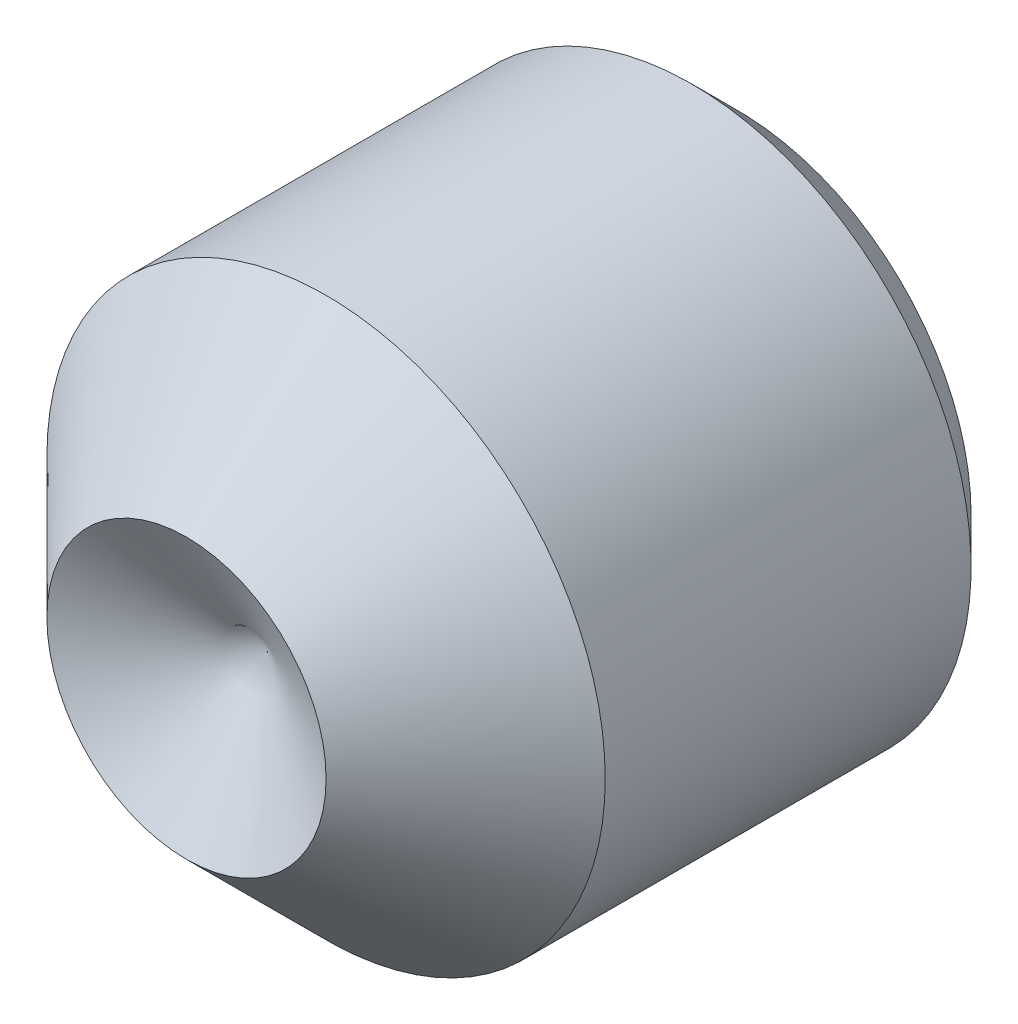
ISO-10303-21;
HEADER;
FILE_DESCRIPTION(('STEP AP214'),'2;1');
FILE_NAME('part.step','',(''),(''),'','','');
FILE_SCHEMA(('AUTOMOTIVE_DESIGN { 1 0 10303 214 1 1 1 1 }'));
ENDSEC;
DATA;
#1=APPLICATION_CONTEXT('core data for automotive mechanical design processes');
#2=APPLICATION_PROTOCOL_DEFINITION('international standard','automotive_design',2000,#1);
#3=PRODUCT_CONTEXT('',#1,'mechanical');
#4=PRODUCT('Part','Part','',(#3));
#5=PRODUCT_RELATED_PRODUCT_CATEGORY('part','',(#4));
#6=PRODUCT_DEFINITION_FORMATION('','',#4);
#7=PRODUCT_DEFINITION_CONTEXT('part definition',#1,'design');
#8=PRODUCT_DEFINITION('design','',#6,#7);
#9=PRODUCT_DEFINITION_SHAPE('','',#8);
#10=(LENGTH_UNIT() NAMED_UNIT(*) SI_UNIT(.MILLI.,.METRE.));
#11=(NAMED_UNIT(*) PLANE_ANGLE_UNIT() SI_UNIT($,.RADIAN.));
#12=(NAMED_UNIT(*) SI_UNIT($,.STERADIAN.) SOLID_ANGLE_UNIT());
#13=UNCERTAINTY_MEASURE_WITH_UNIT(LENGTH_MEASURE(1.E-05),#10,'distance_accuracy_value','');
#14=(GEOMETRIC_REPRESENTATION_CONTEXT(3) GLOBAL_UNCERTAINTY_ASSIGNED_CONTEXT((#13)) GLOBAL_UNIT_ASSIGNED_CONTEXT((#10,
#11,#12)) REPRESENTATION_CONTEXT('',''));
#15=CARTESIAN_POINT('',(0.,0.,0.));
#16=DIRECTION('',(0.,0.,1.));
#17=DIRECTION('',(1.,0.,0.));
#18=AXIS2_PLACEMENT_3D('',#15,#16,#17);
#19=CARTESIAN_POINT('',(0.,0.,-10.585154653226));
#20=DIRECTION('',(0.,0.,-1.));
#21=DIRECTION('',(-1.,0.,0.));
#22=AXIS2_PLACEMENT_3D('',#19,#20,#21);
#23=CYLINDRICAL_SURFACE('',#22,2.413);
#24=CARTESIAN_POINT('',(0.,0.,0.393699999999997));
#25=DIRECTION('',(0.,0.,-1.));
#26=DIRECTION('',(-1.,0.,0.));
#27=AXIS2_PLACEMENT_3D('',#24,#25,#26);
#28=CIRCLE('',#27,2.413);
#29=CARTESIAN_POINT('',(-2.413,0.,0.393699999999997));
#30=VERTEX_POINT('',#29);
#31=EDGE_CURVE('E58',#30,#30,#28,.T.);
#32=ORIENTED_EDGE('',*,*,#31,.F.);
#33=EDGE_LOOP('',(#32));
#34=FACE_BOUND('',#33,.T.);
#35=CARTESIAN_POINT('',(0.,0.,3.556));
#36=DIRECTION('',(0.,0.,1.));
#37=DIRECTION('',(1.,0.,0.));
#38=AXIS2_PLACEMENT_3D('',#35,#36,#37);
#39=CIRCLE('',#38,2.413);
#40=CARTESIAN_POINT('',(2.413,0.,3.556));
#41=VERTEX_POINT('',#40);
#42=EDGE_CURVE('E188',#41,#41,#39,.T.);
#43=ORIENTED_EDGE('',*,*,#42,.F.);
#44=EDGE_LOOP('',(#43));
#45=FACE_BOUND('',#44,.T.);
#46=ADVANCED_FACE('F49',(#34,#45),#23,.T.);
#47=CARTESIAN_POINT('',(0.,0.,0.));
#48=DIRECTION('',(0.,0.,1.));
#49=DIRECTION('',(1.,0.,0.));
#50=AXIS2_PLACEMENT_3D('',#47,#48,#49);
#51=PLANE('',#50);
#52=DIRECTION('',(-0.5,-0.866025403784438,0.));
#53=VECTOR('',#52,1.);
#54=CARTESIAN_POINT('',(1.37408209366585,0.,0.));
#55=LINE('',#54,#53);
#56=CARTESIAN_POINT('',(1.37408209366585,0.,0.));
#57=VERTEX_POINT('',#56);
#58=CARTESIAN_POINT('',(0.687041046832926,-1.18999,1.45716771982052E-13));
#59=VERTEX_POINT('',#58);
#60=EDGE_CURVE('E148',#57,#59,#55,.T.);
#61=ORIENTED_EDGE('',*,*,#60,.F.);
#62=DIRECTION('',(0.5,-0.866025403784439,0.));
#63=VECTOR('',#62,1.);
#64=CARTESIAN_POINT('',(0.687041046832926,1.18999,0.));
#65=LINE('',#64,#63);
#66=CARTESIAN_POINT('',(0.687041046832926,1.18999,0.));
#67=VERTEX_POINT('',#66);
#68=EDGE_CURVE('E65',#67,#57,#65,.T.);
#69=ORIENTED_EDGE('',*,*,#68,.F.);
#70=DIRECTION('',(1.,0.,0.));
#71=VECTOR('',#70,1.);
#72=CARTESIAN_POINT('',(-0.687041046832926,1.18999,0.));
#73=LINE('',#72,#71);
#74=CARTESIAN_POINT('',(-0.687041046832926,1.18999,0.));
#75=VERTEX_POINT('',#74);
#76=EDGE_CURVE('E162',#75,#67,#73,.T.);
#77=ORIENTED_EDGE('',*,*,#76,.F.);
#78=DIRECTION('',(0.5,0.866025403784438,0.));
#79=VECTOR('',#78,1.);
#80=CARTESIAN_POINT('',(-1.37408209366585,0.,0.));
#81=LINE('',#80,#79);
#82=CARTESIAN_POINT('',(-1.37408209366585,0.,0.));
#83=VERTEX_POINT('',#82);
#84=EDGE_CURVE('E159',#83,#75,#81,.T.);
#85=ORIENTED_EDGE('',*,*,#84,.F.);
#86=DIRECTION('',(-0.499999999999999,0.866025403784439,0.));
#87=VECTOR('',#86,1.);
#88=CARTESIAN_POINT('',(-0.687041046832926,-1.18999,1.45716771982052E-13));
#89=LINE('',#88,#87);
#90=CARTESIAN_POINT('',(-0.687041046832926,-1.18999,1.45716771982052E-13));
#91=VERTEX_POINT('',#90);
#92=EDGE_CURVE('E115',#91,#83,#89,.T.);
#93=ORIENTED_EDGE('',*,*,#92,.F.);
#94=DIRECTION('',(-1.,0.,0.));
#95=VECTOR('',#94,1.);
#96=CARTESIAN_POINT('',(0.687041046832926,-1.18999,1.45716771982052E-13));
#97=LINE('',#96,#95);
#98=EDGE_CURVE('E153',#59,#91,#97,.T.);
#99=ORIENTED_EDGE('',*,*,#98,.F.);
#100=EDGE_LOOP('',(#61,#69,#77,#85,#93,#99));
#101=FACE_BOUND('',#100,.T.);
#102=CARTESIAN_POINT('',(0.,0.,0.));
#103=DIRECTION('',(0.,0.,-1.));
#104=DIRECTION('',(-1.,0.,0.));
#105=AXIS2_PLACEMENT_3D('',#102,#103,#104);
#106=CIRCLE('',#105,2.0193);
#107=CARTESIAN_POINT('',(-2.0193,0.,0.));
#108=VERTEX_POINT('',#107);
#109=EDGE_CURVE('E11',#108,#108,#106,.T.);
#110=ORIENTED_EDGE('',*,*,#109,.T.);
#111=EDGE_LOOP('',(#110));
#112=FACE_BOUND('',#111,.T.);
#113=ADVANCED_FACE('F51',(#101,#112),#51,.F.);
#114=CARTESIAN_POINT('',(0.,0.,0.393699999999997));
#115=DIRECTION('',(0.,0.,1.));
#116=DIRECTION('',(1.,0.,0.));
#117=AXIS2_PLACEMENT_3D('',#114,#115,#116);
#118=CONICAL_SURFACE('',#117,2.413,0.785398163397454);
#119=ORIENTED_EDGE('',*,*,#109,.F.);
#120=EDGE_LOOP('',(#119));
#121=FACE_BOUND('',#120,.T.);
#122=ORIENTED_EDGE('',*,*,#31,.T.);
#123=EDGE_LOOP('',(#122));
#124=FACE_BOUND('',#123,.T.);
#125=ADVANCED_FACE('F181',(#121,#124),#118,.T.);
#126=CARTESIAN_POINT('',(0.687041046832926,1.18999,2.5));
#127=DIRECTION('',(0.866025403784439,0.5,0.));
#128=DIRECTION('',(-0.5,0.866025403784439,0.));
#129=AXIS2_PLACEMENT_3D('',#126,#127,#128);
#130=PLANE('',#129);
#131=ORIENTED_EDGE('',*,*,#68,.T.);
#132=DIRECTION('',(0.,0.,-1.));
#133=VECTOR('',#132,1.);
#134=CARTESIAN_POINT('',(1.37408209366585,0.,2.5));
#135=LINE('',#134,#133);
#136=CARTESIAN_POINT('',(1.37408209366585,0.,2.5));
#137=VERTEX_POINT('',#136);
#138=EDGE_CURVE('E96',#137,#57,#135,.T.);
#139=ORIENTED_EDGE('',*,*,#138,.F.);
#140=DIRECTION('',(0.5,-0.866025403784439,0.));
#141=VECTOR('',#140,1.);
#142=CARTESIAN_POINT('',(0.687041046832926,1.18999,2.5));
#143=LINE('',#142,#141);
#144=CARTESIAN_POINT('',(0.687041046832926,1.18999,2.5));
#145=VERTEX_POINT('',#144);
#146=EDGE_CURVE('E165',#145,#137,#143,.T.);
#147=ORIENTED_EDGE('',*,*,#146,.F.);
#148=DIRECTION('',(0.,0.,-1.));
#149=VECTOR('',#148,1.);
#150=CARTESIAN_POINT('',(0.687041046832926,1.18999,2.5));
#151=LINE('',#150,#149);
#152=EDGE_CURVE('E73',#145,#67,#151,.T.);
#153=ORIENTED_EDGE('',*,*,#152,.T.);
#154=EDGE_LOOP('',(#131,#139,#147,#153));
#155=FACE_BOUND('',#154,.T.);
#156=ADVANCED_FACE('F211',(#155),#130,.F.);
#157=CARTESIAN_POINT('',(-0.687041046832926,1.18999,2.5));
#158=DIRECTION('',(0.,1.,0.));
#159=DIRECTION('',(-1.,0.,0.));
#160=AXIS2_PLACEMENT_3D('',#157,#158,#159);
#161=PLANE('',#160);
#162=ORIENTED_EDGE('',*,*,#76,.T.);
#163=ORIENTED_EDGE('',*,*,#152,.F.);
#164=DIRECTION('',(1.,0.,0.));
#165=VECTOR('',#164,1.);
#166=CARTESIAN_POINT('',(-0.687041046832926,1.18999,2.5));
#167=LINE('',#166,#165);
#168=CARTESIAN_POINT('',(-0.687041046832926,1.18999,2.5));
#169=VERTEX_POINT('',#168);
#170=EDGE_CURVE('E129',#169,#145,#167,.T.);
#171=ORIENTED_EDGE('',*,*,#170,.F.);
#172=DIRECTION('',(0.,0.,-1.));
#173=VECTOR('',#172,1.);
#174=CARTESIAN_POINT('',(-0.687041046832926,1.18999,2.5));
#175=LINE('',#174,#173);
#176=EDGE_CURVE('E120',#169,#75,#175,.T.);
#177=ORIENTED_EDGE('',*,*,#176,.T.);
#178=EDGE_LOOP('',(#162,#163,#171,#177));
#179=FACE_BOUND('',#178,.T.);
#180=ADVANCED_FACE('F209',(#179),#161,.F.);
#181=CARTESIAN_POINT('',(-1.37408209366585,0.,2.5));
#182=DIRECTION('',(-0.866025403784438,0.5,0.));
#183=DIRECTION('',(-0.5,-0.866025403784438,0.));
#184=AXIS2_PLACEMENT_3D('',#181,#182,#183);
#185=PLANE('',#184);
#186=ORIENTED_EDGE('',*,*,#84,.T.);
#187=ORIENTED_EDGE('',*,*,#176,.F.);
#188=DIRECTION('',(0.5,0.866025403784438,0.));
#189=VECTOR('',#188,1.);
#190=CARTESIAN_POINT('',(-1.37408209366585,0.,2.5));
#191=LINE('',#190,#189);
#192=CARTESIAN_POINT('',(-1.37408209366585,0.,2.5));
#193=VERTEX_POINT('',#192);
#194=EDGE_CURVE('E124',#193,#169,#191,.T.);
#195=ORIENTED_EDGE('',*,*,#194,.F.);
#196=DIRECTION('',(0.,0.,-1.));
#197=VECTOR('',#196,1.);
#198=CARTESIAN_POINT('',(-1.37408209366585,0.,2.5));
#199=LINE('',#198,#197);
#200=EDGE_CURVE('E108',#193,#83,#199,.T.);
#201=ORIENTED_EDGE('',*,*,#200,.T.);
#202=EDGE_LOOP('',(#186,#187,#195,#201));
#203=FACE_BOUND('',#202,.T.);
#204=ADVANCED_FACE('F125',(#203),#185,.F.);
#205=CARTESIAN_POINT('',(-0.687041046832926,-1.18999,2.50000000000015));
#206=DIRECTION('',(-0.866025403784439,-0.499999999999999,0.));
#207=DIRECTION('',(0.499999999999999,-0.866025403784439,0.));
#208=AXIS2_PLACEMENT_3D('',#205,#206,#207);
#209=PLANE('',#208);
#210=ORIENTED_EDGE('',*,*,#92,.T.);
#211=ORIENTED_EDGE('',*,*,#200,.F.);
#212=DIRECTION('',(-0.499999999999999,0.866025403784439,0.));
#213=VECTOR('',#212,1.);
#214=CARTESIAN_POINT('',(-0.687041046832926,-1.18999,2.50000000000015));
#215=LINE('',#214,#213);
#216=CARTESIAN_POINT('',(-0.687041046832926,-1.18999,2.50000000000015));
#217=VERTEX_POINT('',#216);
#218=EDGE_CURVE('E112',#217,#193,#215,.T.);
#219=ORIENTED_EDGE('',*,*,#218,.F.);
#220=DIRECTION('',(0.,0.,-1.));
#221=VECTOR('',#220,1.);
#222=CARTESIAN_POINT('',(-0.687041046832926,-1.18999,2.50000000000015));
#223=LINE('',#222,#221);
#224=EDGE_CURVE('E121',#217,#91,#223,.T.);
#225=ORIENTED_EDGE('',*,*,#224,.T.);
#226=EDGE_LOOP('',(#210,#211,#219,#225));
#227=FACE_BOUND('',#226,.T.);
#228=ADVANCED_FACE('F110',(#227),#209,.F.);
#229=CARTESIAN_POINT('',(0.687041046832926,-1.18999,2.50000000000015));
#230=DIRECTION('',(0.,-1.,0.));
#231=DIRECTION('',(0.,0.,-1.));
#232=AXIS2_PLACEMENT_3D('',#229,#230,#231);
#233=PLANE('',#232);
#234=ORIENTED_EDGE('',*,*,#98,.T.);
#235=ORIENTED_EDGE('',*,*,#224,.F.);
#236=DIRECTION('',(-1.,0.,0.));
#237=VECTOR('',#236,1.);
#238=CARTESIAN_POINT('',(0.687041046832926,-1.18999,2.50000000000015));
#239=LINE('',#238,#237);
#240=CARTESIAN_POINT('',(0.687041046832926,-1.18999,2.50000000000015));
#241=VERTEX_POINT('',#240);
#242=EDGE_CURVE('E135',#241,#217,#239,.T.);
#243=ORIENTED_EDGE('',*,*,#242,.F.);
#244=DIRECTION('',(0.,0.,-1.));
#245=VECTOR('',#244,1.);
#246=CARTESIAN_POINT('',(0.687041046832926,-1.18999,2.50000000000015));
#247=LINE('',#246,#245);
#248=EDGE_CURVE('E172',#241,#59,#247,.T.);
#249=ORIENTED_EDGE('',*,*,#248,.T.);
#250=EDGE_LOOP('',(#234,#235,#243,#249));
#251=FACE_BOUND('',#250,.T.);
#252=ADVANCED_FACE('F205',(#251),#233,.F.);
#253=CARTESIAN_POINT('',(1.37408209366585,0.,2.5));
#254=DIRECTION('',(0.866025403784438,-0.5,0.));
#255=DIRECTION('',(0.5,0.866025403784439,0.));
#256=AXIS2_PLACEMENT_3D('',#253,#254,#255);
#257=PLANE('',#256);
#258=ORIENTED_EDGE('',*,*,#60,.T.);
#259=ORIENTED_EDGE('',*,*,#248,.F.);
#260=DIRECTION('',(-0.5,-0.866025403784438,0.));
#261=VECTOR('',#260,1.);
#262=CARTESIAN_POINT('',(1.37408209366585,0.,2.5));
#263=LINE('',#262,#261);
#264=EDGE_CURVE('E140',#137,#241,#263,.T.);
#265=ORIENTED_EDGE('',*,*,#264,.F.);
#266=ORIENTED_EDGE('',*,*,#138,.T.);
#267=EDGE_LOOP('',(#258,#259,#265,#266));
#268=FACE_BOUND('',#267,.T.);
#269=ADVANCED_FACE('F201',(#268),#257,.F.);
#270=CARTESIAN_POINT('',(0.687041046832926,1.18999,2.5));
#271=DIRECTION('',(0.,0.,1.));
#272=DIRECTION('',(1.,0.,0.));
#273=AXIS2_PLACEMENT_3D('',#270,#271,#272);
#274=PLANE('',#273);
#275=ORIENTED_EDGE('',*,*,#146,.T.);
#276=ORIENTED_EDGE('',*,*,#264,.T.);
#277=ORIENTED_EDGE('',*,*,#242,.T.);
#278=ORIENTED_EDGE('',*,*,#218,.T.);
#279=ORIENTED_EDGE('',*,*,#194,.T.);
#280=ORIENTED_EDGE('',*,*,#170,.T.);
#281=EDGE_LOOP('',(#275,#276,#277,#278,#279,#280));
#282=FACE_BOUND('',#281,.T.);
#283=ADVANCED_FACE('F132',(#282),#274,.F.);
#284=CARTESIAN_POINT('',(0.,0.,4.06592690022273));
#285=DIRECTION('',(0.,0.,1.));
#286=DIRECTION('',(1.,0.,0.));
#287=AXIS2_PLACEMENT_3D('',#284,#285,#286);
#288=CONICAL_SURFACE('',#287,0.,1.0471975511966);
#289=CARTESIAN_POINT('',(0.,0.,4.7625));
#290=DIRECTION('',(0.,0.,1.));
#291=DIRECTION('',(1.,0.,0.));
#292=AXIS2_PLACEMENT_3D('',#289,#290,#291);
#293=CIRCLE('',#292,1.2065);
#294=CARTESIAN_POINT('',(1.2065,0.,4.7625));
#295=VERTEX_POINT('',#294);
#296=EDGE_CURVE('E149',#295,#295,#293,.T.);
#297=ORIENTED_EDGE('',*,*,#296,.T.);
#298=EDGE_LOOP('',(#297));
#299=FACE_BOUND('',#298,.T.);
#300=CARTESIAN_POINT('',(0.,0.,4.06592690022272));
#301=VERTEX_POINT('',#300);
#302=VERTEX_LOOP('',#301);
#303=FACE_BOUND('',#302,.T.);
#304=ADVANCED_FACE('F284',(#299,#303),#288,.F.);
#305=CARTESIAN_POINT('',(0.,0.,4.7625));
#306=DIRECTION('',(0.,0.,-1.));
#307=DIRECTION('',(-1.,0.,0.));
#308=AXIS2_PLACEMENT_3D('',#305,#306,#307);
#309=CONICAL_SURFACE('',#308,1.2065,0.785398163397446);
#310=ORIENTED_EDGE('',*,*,#42,.T.);
#311=EDGE_LOOP('',(#310));
#312=FACE_BOUND('',#311,.T.);
#313=ORIENTED_EDGE('',*,*,#296,.F.);
#314=EDGE_LOOP('',(#313));
#315=FACE_BOUND('',#314,.T.);
#316=ADVANCED_FACE('F294',(#312,#315),#309,.T.);
#317=CLOSED_SHELL('',(#46,#113,#125,#156,#180,#204,#228,#252,#269,#283,#304,#316));
#318=MANIFOLD_SOLID_BREP('B2',#317);
#319=ADVANCED_BREP_SHAPE_REPRESENTATION('',(#18,#318),#14);
#320=SHAPE_DEFINITION_REPRESENTATION(#9,#319);
ENDSEC;
END-ISO-10303-21;
